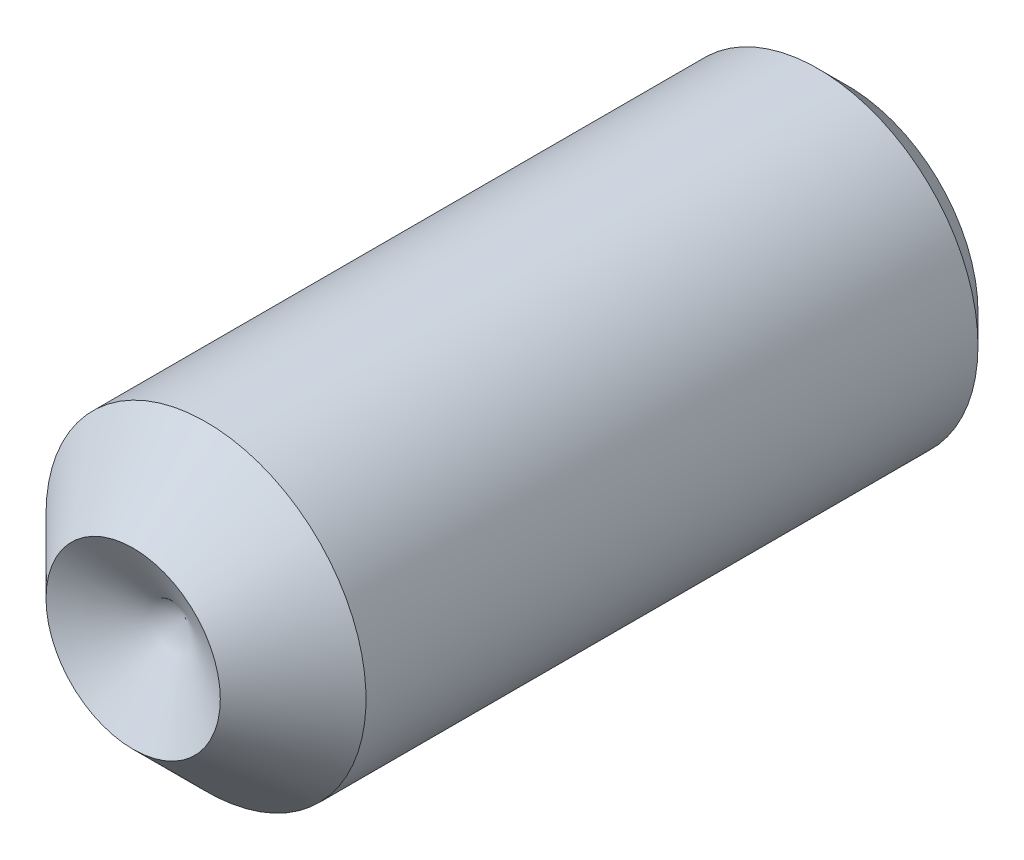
from build123d import *

# Parameters (mm, degrees)
SKETCH1_R     = 1.4224
SHANK_DEPTH   = 6.35
HEX_2_DEPTH   = 1.27
CHAMFER1_SIZE = 0.262466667


with BuildPart() as part:
    # Sketch1 → Shank (new body)
    with BuildSketch(Plane.XY):
        Circle(SKETCH1_R)
    extrude(amount=SHANK_DEPTH)

    # Sketch3 → Cup and Chamfer (revolve, cut)
    with BuildSketch(Plane(origin=(0, 0, 0), x_dir=(1, 0, 0), z_dir=(0, 1, 0)), mode=Mode.PRIVATE) as cup_and_chamfer_sk:
        Polygon((0, -5.884513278), (0.7747, -6.35), (1.4224, -5.7023), (1.4224, -7.466788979), (0, -7.466788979), align=None)
    revolve(cup_and_chamfer_sk.sketch.rotate(Axis((0, 0, -0.855169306), (0, 0, 1)), 180), axis=Axis((0, 0, -0.855169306), (0, 0, 1)), mode=Mode.SUBTRACT)

    # Sketch7 → Hex 2 (cut)
    with BuildSketch(Plane(origin=(-1.013776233, 4.128685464, 0), x_dir=(-1, 0, 0), z_dir=(0, 0, -1))):
        Polygon((-1.648776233, -4.495302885), (-1.648776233, -3.762068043), (-1.013776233, -3.395450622), (-0.378776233, -3.762068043), (-0.378776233, -4.495302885), (-1.013776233, -4.861920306), align=None)
    extrude(amount=-HEX_2_DEPTH, mode=Mode.SUBTRACT)

    # Chamfer1
    chamfer1_edges = [part.edges().sort_by_distance(p)[0] for p in [
        (-1.4224, 0, 0),
    ]]
    chamfer(chamfer1_edges, length=CHAMFER1_SIZE)


solid = part.part
